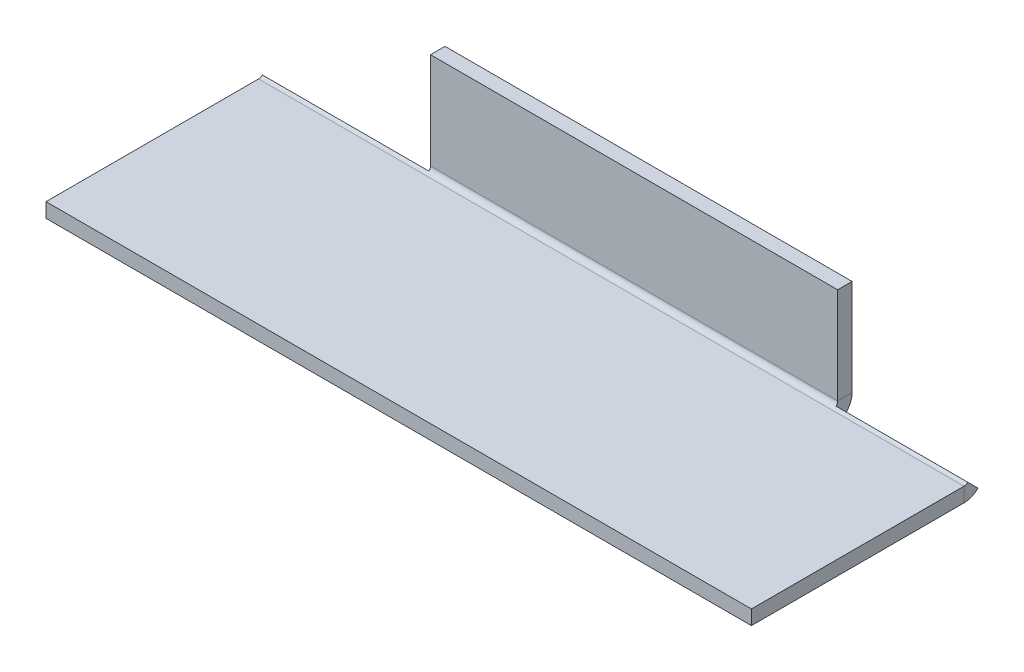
ISO-10303-21;
HEADER;
FILE_DESCRIPTION(('STEP AP214'),'2;1');
FILE_NAME('part.step','',(''),(''),'','','');
FILE_SCHEMA(('AUTOMOTIVE_DESIGN { 1 0 10303 214 1 1 1 1 }'));
ENDSEC;
DATA;
#1=APPLICATION_CONTEXT('core data for automotive mechanical design processes');
#2=APPLICATION_PROTOCOL_DEFINITION('international standard','automotive_design',2000,#1);
#3=PRODUCT_CONTEXT('',#1,'mechanical');
#4=PRODUCT('Part','Part','',(#3));
#5=PRODUCT_RELATED_PRODUCT_CATEGORY('part','',(#4));
#6=PRODUCT_DEFINITION_FORMATION('','',#4);
#7=PRODUCT_DEFINITION_CONTEXT('part definition',#1,'design');
#8=PRODUCT_DEFINITION('design','',#6,#7);
#9=PRODUCT_DEFINITION_SHAPE('','',#8);
#10=(LENGTH_UNIT() NAMED_UNIT(*) SI_UNIT(.MILLI.,.METRE.));
#11=(NAMED_UNIT(*) PLANE_ANGLE_UNIT() SI_UNIT($,.RADIAN.));
#12=(NAMED_UNIT(*) SI_UNIT($,.STERADIAN.) SOLID_ANGLE_UNIT());
#13=UNCERTAINTY_MEASURE_WITH_UNIT(LENGTH_MEASURE(1.E-05),#10,'distance_accuracy_value','');
#14=(GEOMETRIC_REPRESENTATION_CONTEXT(3) GLOBAL_UNCERTAINTY_ASSIGNED_CONTEXT((#13)) GLOBAL_UNIT_ASSIGNED_CONTEXT((#10,
#11,#12)) REPRESENTATION_CONTEXT('',''));
#15=CARTESIAN_POINT('',(0.,0.,0.));
#16=DIRECTION('',(0.,0.,1.));
#17=DIRECTION('',(1.,0.,0.));
#18=AXIS2_PLACEMENT_3D('',#15,#16,#17);
#19=CARTESIAN_POINT('',(-55.4246105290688,31.3551467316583,30.1005018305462));
#20=DIRECTION('',(0.,-1.,0.));
#21=DIRECTION('',(-1.,0.,0.));
#22=AXIS2_PLACEMENT_3D('',#19,#20,#21);
#23=PLANE('',#22);
#24=DIRECTION('',(0.,0.,-1.));
#25=VECTOR('',#24,1.);
#26=CARTESIAN_POINT('',(42.0260309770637,31.3551467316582,-0.627322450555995));
#27=LINE('',#26,#25);
#28=CARTESIAN_POINT('',(42.0260309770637,31.3551467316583,30.1005018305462));
#29=VERTEX_POINT('',#28);
#30=CARTESIAN_POINT('',(42.0260309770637,31.3551467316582,0.736600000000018));
#31=VERTEX_POINT('',#30);
#32=EDGE_CURVE('E56',#29,#31,#27,.T.);
#33=ORIENTED_EDGE('',*,*,#32,.T.);
#34=DIRECTION('',(-1.,0.,0.));
#35=VECTOR('',#34,1.);
#36=CARTESIAN_POINT('',(-55.4246105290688,31.3551467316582,0.736600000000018));
#37=LINE('',#36,#35);
#38=CARTESIAN_POINT('',(-55.4246105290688,31.3551467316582,0.736600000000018));
#39=VERTEX_POINT('',#38);
#40=EDGE_CURVE('E48',#31,#39,#37,.T.);
#41=ORIENTED_EDGE('',*,*,#40,.T.);
#42=DIRECTION('',(0.,0.,1.));
#43=VECTOR('',#42,1.);
#44=CARTESIAN_POINT('',(-55.4246105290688,31.3551467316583,30.1005018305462));
#45=LINE('',#44,#43);
#46=CARTESIAN_POINT('',(-55.4246105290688,31.3551467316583,30.1005018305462));
#47=VERTEX_POINT('',#46);
#48=EDGE_CURVE('E64',#39,#47,#45,.T.);
#49=ORIENTED_EDGE('',*,*,#48,.T.);
#50=DIRECTION('',(1.,0.,0.));
#51=VECTOR('',#50,1.);
#52=CARTESIAN_POINT('',(42.0260309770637,31.3551467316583,30.1005018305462));
#53=LINE('',#52,#51);
#54=EDGE_CURVE('E180',#47,#29,#53,.T.);
#55=ORIENTED_EDGE('',*,*,#54,.T.);
#56=EDGE_LOOP('',(#33,#41,#49,#55));
#57=FACE_BOUND('',#56,.T.);
#58=ADVANCED_FACE('F39',(#57),#23,.F.);
#59=CARTESIAN_POINT('',(42.0260309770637,29.3551467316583,30.1005018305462));
#60=DIRECTION('',(0.,0.,1.));
#61=DIRECTION('',(0.,-1.,0.));
#62=AXIS2_PLACEMENT_3D('',#59,#60,#61);
#63=PLANE('',#62);
#64=ORIENTED_EDGE('',*,*,#54,.F.);
#65=DIRECTION('',(0.,1.,0.));
#66=VECTOR('',#65,1.);
#67=CARTESIAN_POINT('',(-55.4246105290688,29.3551467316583,30.1005018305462));
#68=LINE('',#67,#66);
#69=CARTESIAN_POINT('',(-55.4246105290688,29.3551467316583,30.1005018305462));
#70=VERTEX_POINT('',#69);
#71=EDGE_CURVE('E183',#70,#47,#68,.T.);
#72=ORIENTED_EDGE('',*,*,#71,.F.);
#73=DIRECTION('',(1.,0.,0.));
#74=VECTOR('',#73,1.);
#75=CARTESIAN_POINT('',(42.0260309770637,29.3551467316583,30.1005018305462));
#76=LINE('',#75,#74);
#77=CARTESIAN_POINT('',(42.0260309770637,29.3551467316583,30.1005018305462));
#78=VERTEX_POINT('',#77);
#79=EDGE_CURVE('E176',#70,#78,#76,.T.);
#80=ORIENTED_EDGE('',*,*,#79,.T.);
#81=DIRECTION('',(0.,1.,0.));
#82=VECTOR('',#81,1.);
#83=CARTESIAN_POINT('',(42.0260309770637,29.3551467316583,30.1005018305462));
#84=LINE('',#83,#82);
#85=EDGE_CURVE('E186',#78,#29,#84,.T.);
#86=ORIENTED_EDGE('',*,*,#85,.T.);
#87=EDGE_LOOP('',(#64,#72,#80,#86));
#88=FACE_BOUND('',#87,.T.);
#89=ADVANCED_FACE('F203',(#88),#63,.T.);
#90=CARTESIAN_POINT('',(-55.4246105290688,29.3551467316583,30.1005018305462));
#91=DIRECTION('',(-1.,0.,0.));
#92=DIRECTION('',(0.,1.,0.));
#93=AXIS2_PLACEMENT_3D('',#90,#91,#92);
#94=PLANE('',#93);
#95=DIRECTION('',(0.,1.,0.));
#96=VECTOR('',#95,1.);
#97=CARTESIAN_POINT('',(-55.4246105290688,29.3551467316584,0.736600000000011));
#98=LINE('',#97,#96);
#99=CARTESIAN_POINT('',(-55.4246105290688,29.3551467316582,0.736600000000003));
#100=VERTEX_POINT('',#99);
#101=EDGE_CURVE('E190',#100,#39,#98,.T.);
#102=ORIENTED_EDGE('',*,*,#101,.F.);
#103=DIRECTION('',(0.,0.,1.));
#104=VECTOR('',#103,1.);
#105=CARTESIAN_POINT('',(-55.4246105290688,29.3551467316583,30.1005018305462));
#106=LINE('',#105,#104);
#107=EDGE_CURVE('E43',#100,#70,#106,.T.);
#108=ORIENTED_EDGE('',*,*,#107,.T.);
#109=ORIENTED_EDGE('',*,*,#71,.T.);
#110=ORIENTED_EDGE('',*,*,#48,.F.);
#111=EDGE_LOOP('',(#102,#108,#109,#110));
#112=FACE_BOUND('',#111,.T.);
#113=ADVANCED_FACE('F199',(#112),#94,.T.);
#114=CARTESIAN_POINT('',(42.0260309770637,29.3551467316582,-0.627322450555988));
#115=DIRECTION('',(1.,0.,0.));
#116=DIRECTION('',(0.,-1.,0.));
#117=AXIS2_PLACEMENT_3D('',#114,#115,#116);
#118=PLANE('',#117);
#119=DIRECTION('',(0.,-1.,0.));
#120=VECTOR('',#119,1.);
#121=CARTESIAN_POINT('',(42.0260309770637,29.3551467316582,0.736600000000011));
#122=LINE('',#121,#120);
#123=CARTESIAN_POINT('',(42.0260309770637,29.3551467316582,0.736600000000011));
#124=VERTEX_POINT('',#123);
#125=EDGE_CURVE('E12',#31,#124,#122,.T.);
#126=ORIENTED_EDGE('',*,*,#125,.F.);
#127=ORIENTED_EDGE('',*,*,#32,.F.);
#128=ORIENTED_EDGE('',*,*,#85,.F.);
#129=DIRECTION('',(0.,0.,-1.));
#130=VECTOR('',#129,1.);
#131=CARTESIAN_POINT('',(42.0260309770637,29.3551467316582,-0.627322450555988));
#132=LINE('',#131,#130);
#133=EDGE_CURVE('E179',#78,#124,#132,.T.);
#134=ORIENTED_EDGE('',*,*,#133,.T.);
#135=EDGE_LOOP('',(#126,#127,#128,#134));
#136=FACE_BOUND('',#135,.T.);
#137=ADVANCED_FACE('F41',(#136),#118,.T.);
#138=CARTESIAN_POINT('',(-55.4246105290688,29.3551467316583,30.1005018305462));
#139=DIRECTION('',(0.,-1.,0.));
#140=DIRECTION('',(-1.,0.,0.));
#141=AXIS2_PLACEMENT_3D('',#138,#139,#140);
#142=PLANE('',#141);
#143=DIRECTION('',(-1.,0.,0.));
#144=VECTOR('',#143,1.);
#145=CARTESIAN_POINT('',(-55.4246105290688,29.3551467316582,0.736600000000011));
#146=LINE('',#145,#144);
#147=EDGE_CURVE('E185',#124,#100,#146,.T.);
#148=ORIENTED_EDGE('',*,*,#147,.F.);
#149=ORIENTED_EDGE('',*,*,#133,.F.);
#150=ORIENTED_EDGE('',*,*,#79,.F.);
#151=ORIENTED_EDGE('',*,*,#107,.F.);
#152=EDGE_LOOP('',(#148,#149,#150,#151));
#153=FACE_BOUND('',#152,.T.);
#154=ADVANCED_FACE('F260',(#153),#142,.T.);
#155=CARTESIAN_POINT('',(-32.407697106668,45.391825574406,-2.));
#156=DIRECTION('',(0.,1.,0.));
#157=DIRECTION('',(0.,0.,1.));
#158=AXIS2_PLACEMENT_3D('',#155,#156,#157);
#159=PLANE('',#158);
#160=DIRECTION('',(-1.,0.,0.));
#161=VECTOR('',#160,1.);
#162=CARTESIAN_POINT('',(-32.407697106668,45.391825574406,0.));
#163=LINE('',#162,#161);
#164=CARTESIAN_POINT('',(23.8352445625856,45.391825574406,0.));
#165=VERTEX_POINT('',#164);
#166=CARTESIAN_POINT('',(-32.407697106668,45.391825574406,0.));
#167=VERTEX_POINT('',#166);
#168=EDGE_CURVE('E247',#165,#167,#163,.T.);
#169=ORIENTED_EDGE('',*,*,#168,.F.);
#170=DIRECTION('',(0.,0.,1.));
#171=VECTOR('',#170,1.);
#172=CARTESIAN_POINT('',(23.8352445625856,45.391825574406,-2.));
#173=LINE('',#172,#171);
#174=CARTESIAN_POINT('',(23.8352445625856,45.391825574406,-2.));
#175=VERTEX_POINT('',#174);
#176=EDGE_CURVE('E182',#175,#165,#173,.T.);
#177=ORIENTED_EDGE('',*,*,#176,.F.);
#178=DIRECTION('',(-1.,0.,0.));
#179=VECTOR('',#178,1.);
#180=CARTESIAN_POINT('',(-32.407697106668,45.391825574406,-2.));
#181=LINE('',#180,#179);
#182=CARTESIAN_POINT('',(-32.407697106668,45.391825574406,-2.));
#183=VERTEX_POINT('',#182);
#184=EDGE_CURVE('E171',#175,#183,#181,.T.);
#185=ORIENTED_EDGE('',*,*,#184,.T.);
#186=DIRECTION('',(0.,0.,1.));
#187=VECTOR('',#186,1.);
#188=CARTESIAN_POINT('',(-32.407697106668,45.391825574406,-2.));
#189=LINE('',#188,#187);
#190=EDGE_CURVE('E164',#183,#167,#189,.T.);
#191=ORIENTED_EDGE('',*,*,#190,.T.);
#192=EDGE_LOOP('',(#169,#177,#185,#191));
#193=FACE_BOUND('',#192,.T.);
#194=ADVANCED_FACE('F258',(#193),#159,.T.);
#195=CARTESIAN_POINT('',(-55.4246105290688,0.,-2.));
#196=DIRECTION('',(0.,0.,-1.));
#197=DIRECTION('',(-1.,0.,0.));
#198=AXIS2_PLACEMENT_3D('',#195,#196,#197);
#199=PLANE('',#198);
#200=DIRECTION('',(0.,1.,0.));
#201=VECTOR('',#200,1.);
#202=CARTESIAN_POINT('',(23.8352445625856,45.391825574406,-2.));
#203=LINE('',#202,#201);
#204=CARTESIAN_POINT('',(23.8352445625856,32.0917467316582,-2.));
#205=VERTEX_POINT('',#204);
#206=EDGE_CURVE('E162',#205,#175,#203,.T.);
#207=ORIENTED_EDGE('',*,*,#206,.F.);
#208=DIRECTION('',(-1.,0.,0.));
#209=VECTOR('',#208,1.);
#210=CARTESIAN_POINT('',(-55.4246105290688,32.0917467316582,-2.));
#211=LINE('',#210,#209);
#212=CARTESIAN_POINT('',(-32.407697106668,32.0917467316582,-2.));
#213=VERTEX_POINT('',#212);
#214=EDGE_CURVE('E149',#205,#213,#211,.T.);
#215=ORIENTED_EDGE('',*,*,#214,.T.);
#216=DIRECTION('',(0.,-1.,0.));
#217=VECTOR('',#216,1.);
#218=CARTESIAN_POINT('',(-32.407697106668,30.7278242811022,-2.));
#219=LINE('',#218,#217);
#220=EDGE_CURVE('E142',#183,#213,#219,.T.);
#221=ORIENTED_EDGE('',*,*,#220,.F.);
#222=ORIENTED_EDGE('',*,*,#184,.F.);
#223=EDGE_LOOP('',(#207,#215,#221,#222));
#224=FACE_BOUND('',#223,.T.);
#225=ADVANCED_FACE('F159',(#224),#199,.T.);
#226=CARTESIAN_POINT('',(-32.407697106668,30.7278242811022,-2.));
#227=DIRECTION('',(-1.,0.,0.));
#228=DIRECTION('',(0.,0.,1.));
#229=AXIS2_PLACEMENT_3D('',#226,#227,#228);
#230=PLANE('',#229);
#231=ORIENTED_EDGE('',*,*,#220,.T.);
#232=DIRECTION('',(0.,0.,1.));
#233=VECTOR('',#232,1.);
#234=CARTESIAN_POINT('',(-32.407697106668,32.0917467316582,-1.99999999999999));
#235=LINE('',#234,#233);
#236=CARTESIAN_POINT('',(-32.407697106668,32.0917467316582,0.));
#237=VERTEX_POINT('',#236);
#238=EDGE_CURVE('E131',#213,#237,#235,.T.);
#239=ORIENTED_EDGE('',*,*,#238,.T.);
#240=DIRECTION('',(0.,-1.,0.));
#241=VECTOR('',#240,1.);
#242=CARTESIAN_POINT('',(-32.407697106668,30.7278242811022,0.));
#243=LINE('',#242,#241);
#244=EDGE_CURVE('E244',#167,#237,#243,.T.);
#245=ORIENTED_EDGE('',*,*,#244,.F.);
#246=ORIENTED_EDGE('',*,*,#190,.F.);
#247=EDGE_LOOP('',(#231,#239,#245,#246));
#248=FACE_BOUND('',#247,.T.);
#249=ADVANCED_FACE('F166',(#248),#230,.T.);
#250=CARTESIAN_POINT('',(-55.4246105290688,0.,0.));
#251=DIRECTION('',(0.,0.,-1.));
#252=DIRECTION('',(-1.,0.,0.));
#253=AXIS2_PLACEMENT_3D('',#250,#251,#252);
#254=PLANE('',#253);
#255=DIRECTION('',(-1.,0.,0.));
#256=VECTOR('',#255,1.);
#257=CARTESIAN_POINT('',(-55.4246105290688,32.0917467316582,0.));
#258=LINE('',#257,#256);
#259=CARTESIAN_POINT('',(23.8352445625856,32.0917467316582,0.));
#260=VERTEX_POINT('',#259);
#261=EDGE_CURVE('E173',#260,#237,#258,.T.);
#262=ORIENTED_EDGE('',*,*,#261,.F.);
#263=DIRECTION('',(0.,1.,0.));
#264=VECTOR('',#263,1.);
#265=CARTESIAN_POINT('',(23.8352445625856,45.391825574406,0.));
#266=LINE('',#265,#264);
#267=EDGE_CURVE('E141',#260,#165,#266,.T.);
#268=ORIENTED_EDGE('',*,*,#267,.T.);
#269=ORIENTED_EDGE('',*,*,#168,.T.);
#270=ORIENTED_EDGE('',*,*,#244,.T.);
#271=EDGE_LOOP('',(#262,#268,#269,#270));
#272=FACE_BOUND('',#271,.T.);
#273=ADVANCED_FACE('F252',(#272),#254,.F.);
#274=CARTESIAN_POINT('',(23.8352445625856,45.391825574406,-2.));
#275=DIRECTION('',(1.,0.,0.));
#276=DIRECTION('',(0.,0.,-1.));
#277=AXIS2_PLACEMENT_3D('',#274,#275,#276);
#278=PLANE('',#277);
#279=ORIENTED_EDGE('',*,*,#267,.F.);
#280=DIRECTION('',(0.,0.,-1.));
#281=VECTOR('',#280,1.);
#282=CARTESIAN_POINT('',(23.8352445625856,32.0917467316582,-2.00000000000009));
#283=LINE('',#282,#281);
#284=EDGE_CURVE('E242',#260,#205,#283,.T.);
#285=ORIENTED_EDGE('',*,*,#284,.T.);
#286=ORIENTED_EDGE('',*,*,#206,.T.);
#287=ORIENTED_EDGE('',*,*,#176,.T.);
#288=EDGE_LOOP('',(#279,#285,#286,#287));
#289=FACE_BOUND('',#288,.T.);
#290=ADVANCED_FACE('F256',(#289),#278,.T.);
#291=CARTESIAN_POINT('',(23.8352445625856,32.0917467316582,0.7366));
#292=DIRECTION('',(1.,0.,0.));
#293=DIRECTION('',(0.,0.,-1.));
#294=AXIS2_PLACEMENT_3D('',#291,#292,#293);
#295=PLANE('',#294);
#296=ORIENTED_EDGE('',*,*,#284,.F.);
#297=CARTESIAN_POINT('',(23.8352445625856,32.0917467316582,0.7366));
#298=DIRECTION('',(-1.,0.,0.));
#299=DIRECTION('',(0.,0.,1.));
#300=AXIS2_PLACEMENT_3D('',#297,#298,#299);
#301=CIRCLE('',#300,0.7366);
#302=CARTESIAN_POINT('',(23.8352445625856,31.5708918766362,0.215745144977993));
#303=VERTEX_POINT('',#302);
#304=EDGE_CURVE('E226',#260,#303,#301,.T.);
#305=ORIENTED_EDGE('',*,*,#304,.T.);
#306=DIRECTION('',(0.,-0.707106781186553,-0.707106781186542));
#307=VECTOR('',#306,1.);
#308=CARTESIAN_POINT('',(23.8352445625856,30.1566783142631,-1.19846841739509));
#309=LINE('',#308,#307);
#310=CARTESIAN_POINT('',(23.8352445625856,30.1566783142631,-1.19846841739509));
#311=VERTEX_POINT('',#310);
#312=EDGE_CURVE('E175',#303,#311,#309,.T.);
#313=ORIENTED_EDGE('',*,*,#312,.T.);
#314=CARTESIAN_POINT('',(23.8352445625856,32.0917467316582,0.7366));
#315=DIRECTION('',(-1.,0.,0.));
#316=DIRECTION('',(0.,0.,-1.));
#317=AXIS2_PLACEMENT_3D('',#314,#315,#316);
#318=CIRCLE('',#317,2.7366);
#319=EDGE_CURVE('E233',#205,#311,#318,.T.);
#320=ORIENTED_EDGE('',*,*,#319,.F.);
#321=EDGE_LOOP('',(#296,#305,#313,#320));
#322=FACE_BOUND('',#321,.T.);
#323=ADVANCED_FACE('F280',(#322),#295,.T.);
#324=CARTESIAN_POINT('',(32.9306377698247,30.1566783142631,-1.19846841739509));
#325=DIRECTION('',(0.,0.707106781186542,-0.707106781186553));
#326=DIRECTION('',(1.,0.,0.));
#327=AXIS2_PLACEMENT_3D('',#324,#325,#326);
#328=PLANE('',#327);
#329=ORIENTED_EDGE('',*,*,#312,.F.);
#330=DIRECTION('',(-1.,0.,0.));
#331=VECTOR('',#330,1.);
#332=CARTESIAN_POINT('',(93.2230997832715,31.5708918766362,0.215745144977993));
#333=LINE('',#332,#331);
#334=CARTESIAN_POINT('',(42.0260309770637,31.5708918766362,0.215745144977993));
#335=VERTEX_POINT('',#334);
#336=EDGE_CURVE('E222',#303,#335,#333,.F.);
#337=ORIENTED_EDGE('',*,*,#336,.T.);
#338=DIRECTION('',(0.,-0.707106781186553,-0.707106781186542));
#339=VECTOR('',#338,1.);
#340=CARTESIAN_POINT('',(42.0260309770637,30.1566783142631,-1.19846841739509));
#341=LINE('',#340,#339);
#342=CARTESIAN_POINT('',(42.0260309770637,30.1566783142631,-1.19846841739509));
#343=VERTEX_POINT('',#342);
#344=EDGE_CURVE('E221',#335,#343,#341,.T.);
#345=ORIENTED_EDGE('',*,*,#344,.T.);
#346=DIRECTION('',(1.,0.,0.));
#347=VECTOR('',#346,1.);
#348=CARTESIAN_POINT('',(42.0260309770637,30.1566783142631,-1.19846841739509));
#349=LINE('',#348,#347);
#350=EDGE_CURVE('E453',#311,#343,#349,.T.);
#351=ORIENTED_EDGE('',*,*,#350,.F.);
#352=EDGE_LOOP('',(#329,#337,#345,#351));
#353=FACE_BOUND('',#352,.T.);
#354=ADVANCED_FACE('F302',(#353),#328,.T.);
#355=CARTESIAN_POINT('',(42.0260309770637,32.0917467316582,0.7366));
#356=DIRECTION('',(1.,0.,0.));
#357=DIRECTION('',(0.,0.,-1.));
#358=AXIS2_PLACEMENT_3D('',#355,#356,#357);
#359=PLANE('',#358);
#360=ORIENTED_EDGE('',*,*,#344,.F.);
#361=CARTESIAN_POINT('',(42.0260309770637,32.0917467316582,0.7366));
#362=DIRECTION('',(-1.,0.,0.));
#363=DIRECTION('',(0.,0.,1.));
#364=AXIS2_PLACEMENT_3D('',#361,#362,#363);
#365=CIRCLE('',#364,0.7366);
#366=EDGE_CURVE('E216',#335,#31,#365,.T.);
#367=ORIENTED_EDGE('',*,*,#366,.T.);
#368=ORIENTED_EDGE('',*,*,#125,.T.);
#369=CARTESIAN_POINT('',(42.0260309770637,32.0917467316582,0.7366));
#370=DIRECTION('',(-1.,0.,0.));
#371=DIRECTION('',(0.,0.,-1.));
#372=AXIS2_PLACEMENT_3D('',#369,#370,#371);
#373=CIRCLE('',#372,2.7366);
#374=EDGE_CURVE('E451',#343,#124,#373,.T.);
#375=ORIENTED_EDGE('',*,*,#374,.F.);
#376=EDGE_LOOP('',(#360,#367,#368,#375));
#377=FACE_BOUND('',#376,.T.);
#378=ADVANCED_FACE('F220',(#377),#359,.T.);
#379=CARTESIAN_POINT('',(-55.4246105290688,32.0917467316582,0.7366));
#380=DIRECTION('',(-1.,0.,0.));
#381=DIRECTION('',(0.,0.,1.));
#382=AXIS2_PLACEMENT_3D('',#379,#380,#381);
#383=PLANE('',#382);
#384=ORIENTED_EDGE('',*,*,#101,.T.);
#385=CARTESIAN_POINT('',(-55.4246105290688,32.0917467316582,0.7366));
#386=DIRECTION('',(-1.,0.,0.));
#387=DIRECTION('',(0.,0.,1.));
#388=AXIS2_PLACEMENT_3D('',#385,#386,#387);
#389=CIRCLE('',#388,0.7366);
#390=CARTESIAN_POINT('',(-55.4246105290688,31.5708918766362,0.215745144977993));
#391=VERTEX_POINT('',#390);
#392=EDGE_CURVE('E219',#39,#391,#389,.F.);
#393=ORIENTED_EDGE('',*,*,#392,.T.);
#394=DIRECTION('',(0.,-0.707106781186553,-0.707106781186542));
#395=VECTOR('',#394,1.);
#396=CARTESIAN_POINT('',(-55.4246105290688,30.1566783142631,-1.19846841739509));
#397=LINE('',#396,#395);
#398=CARTESIAN_POINT('',(-55.4246105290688,30.1566783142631,-1.19846841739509));
#399=VERTEX_POINT('',#398);
#400=EDGE_CURVE('E234',#391,#399,#397,.T.);
#401=ORIENTED_EDGE('',*,*,#400,.T.);
#402=CARTESIAN_POINT('',(-55.4246105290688,32.0917467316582,0.7366));
#403=DIRECTION('',(1.,0.,0.));
#404=DIRECTION('',(0.,0.,1.));
#405=AXIS2_PLACEMENT_3D('',#402,#403,#404);
#406=CIRCLE('',#405,2.7366);
#407=EDGE_CURVE('E449',#100,#399,#406,.T.);
#408=ORIENTED_EDGE('',*,*,#407,.F.);
#409=EDGE_LOOP('',(#384,#393,#401,#408));
#410=FACE_BOUND('',#409,.T.);
#411=ADVANCED_FACE('F317',(#410),#383,.T.);
#412=CARTESIAN_POINT('',(-43.9161538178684,30.1566783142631,-1.19846841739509));
#413=DIRECTION('',(0.,0.707106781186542,-0.707106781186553));
#414=DIRECTION('',(1.,0.,0.));
#415=AXIS2_PLACEMENT_3D('',#412,#413,#414);
#416=PLANE('',#415);
#417=ORIENTED_EDGE('',*,*,#400,.F.);
#418=DIRECTION('',(-1.,0.,0.));
#419=VECTOR('',#418,1.);
#420=CARTESIAN_POINT('',(93.2230997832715,31.5708918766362,0.215745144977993));
#421=LINE('',#420,#419);
#422=CARTESIAN_POINT('',(-32.407697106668,31.5708918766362,0.215745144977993));
#423=VERTEX_POINT('',#422);
#424=EDGE_CURVE('E224',#391,#423,#421,.F.);
#425=ORIENTED_EDGE('',*,*,#424,.T.);
#426=DIRECTION('',(0.,-0.707106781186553,-0.707106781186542));
#427=VECTOR('',#426,1.);
#428=CARTESIAN_POINT('',(-32.407697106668,30.1566783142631,-1.19846841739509));
#429=LINE('',#428,#427);
#430=CARTESIAN_POINT('',(-32.407697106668,30.1566783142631,-1.19846841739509));
#431=VERTEX_POINT('',#430);
#432=EDGE_CURVE('E154',#423,#431,#429,.T.);
#433=ORIENTED_EDGE('',*,*,#432,.T.);
#434=DIRECTION('',(1.,0.,0.));
#435=VECTOR('',#434,1.);
#436=CARTESIAN_POINT('',(-32.407697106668,30.1566783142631,-1.19846841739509));
#437=LINE('',#436,#435);
#438=EDGE_CURVE('E153',#399,#431,#437,.T.);
#439=ORIENTED_EDGE('',*,*,#438,.F.);
#440=EDGE_LOOP('',(#417,#425,#433,#439));
#441=FACE_BOUND('',#440,.T.);
#442=ADVANCED_FACE('F324',(#441),#416,.T.);
#443=CARTESIAN_POINT('',(-32.407697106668,32.0917467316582,0.7366));
#444=DIRECTION('',(-1.,0.,0.));
#445=DIRECTION('',(0.,0.,1.));
#446=AXIS2_PLACEMENT_3D('',#443,#444,#445);
#447=PLANE('',#446);
#448=CARTESIAN_POINT('',(-32.407697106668,32.0917467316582,0.7366));
#449=DIRECTION('',(-1.,0.,0.));
#450=DIRECTION('',(0.,0.,1.));
#451=AXIS2_PLACEMENT_3D('',#448,#449,#450);
#452=CIRCLE('',#451,0.7366);
#453=EDGE_CURVE('E136',#423,#237,#452,.F.);
#454=ORIENTED_EDGE('',*,*,#453,.T.);
#455=ORIENTED_EDGE('',*,*,#238,.F.);
#456=CARTESIAN_POINT('',(-32.407697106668,32.0917467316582,0.7366));
#457=DIRECTION('',(1.,0.,0.));
#458=DIRECTION('',(0.,0.,1.));
#459=AXIS2_PLACEMENT_3D('',#456,#457,#458);
#460=CIRCLE('',#459,2.7366);
#461=EDGE_CURVE('E134',#431,#213,#460,.T.);
#462=ORIENTED_EDGE('',*,*,#461,.F.);
#463=ORIENTED_EDGE('',*,*,#432,.F.);
#464=EDGE_LOOP('',(#454,#455,#462,#463));
#465=FACE_BOUND('',#464,.T.);
#466=ADVANCED_FACE('F133',(#465),#447,.T.);
#467=CARTESIAN_POINT('',(93.2230997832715,32.0917467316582,0.7366));
#468=DIRECTION('',(-1.,0.,0.));
#469=DIRECTION('',(0.,0.,1.));
#470=AXIS2_PLACEMENT_3D('',#467,#468,#469);
#471=CYLINDRICAL_SURFACE('',#470,2.7366);
#472=ORIENTED_EDGE('',*,*,#438,.T.);
#473=ORIENTED_EDGE('',*,*,#461,.T.);
#474=ORIENTED_EDGE('',*,*,#214,.F.);
#475=ORIENTED_EDGE('',*,*,#319,.T.);
#476=ORIENTED_EDGE('',*,*,#350,.T.);
#477=ORIENTED_EDGE('',*,*,#374,.T.);
#478=ORIENTED_EDGE('',*,*,#147,.T.);
#479=ORIENTED_EDGE('',*,*,#407,.T.);
#480=EDGE_LOOP('',(#472,#473,#474,#475,#476,#477,#478,#479));
#481=FACE_BOUND('',#480,.T.);
#482=ADVANCED_FACE('F147',(#481),#471,.T.);
#483=CARTESIAN_POINT('',(93.2230997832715,32.0917467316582,0.7366));
#484=DIRECTION('',(-1.,0.,0.));
#485=DIRECTION('',(0.,0.,1.));
#486=AXIS2_PLACEMENT_3D('',#483,#484,#485);
#487=CYLINDRICAL_SURFACE('',#486,0.7366);
#488=ORIENTED_EDGE('',*,*,#424,.F.);
#489=ORIENTED_EDGE('',*,*,#392,.F.);
#490=ORIENTED_EDGE('',*,*,#40,.F.);
#491=ORIENTED_EDGE('',*,*,#366,.F.);
#492=ORIENTED_EDGE('',*,*,#336,.F.);
#493=ORIENTED_EDGE('',*,*,#304,.F.);
#494=ORIENTED_EDGE('',*,*,#261,.T.);
#495=ORIENTED_EDGE('',*,*,#453,.F.);
#496=EDGE_LOOP('',(#488,#489,#490,#491,#492,#493,#494,#495));
#497=FACE_BOUND('',#496,.T.);
#498=ADVANCED_FACE('F214',(#497),#487,.F.);
#499=CLOSED_SHELL('',(#58,#89,#113,#137,#154,#194,#225,#249,#273,#290,#323,#354,#378,#411,#442,
#466,#482,#498));
#500=MANIFOLD_SOLID_BREP('B2',#499);
#501=ADVANCED_BREP_SHAPE_REPRESENTATION('',(#18,#500),#14);
#502=SHAPE_DEFINITION_REPRESENTATION(#9,#501);
ENDSEC;
END-ISO-10303-21;
